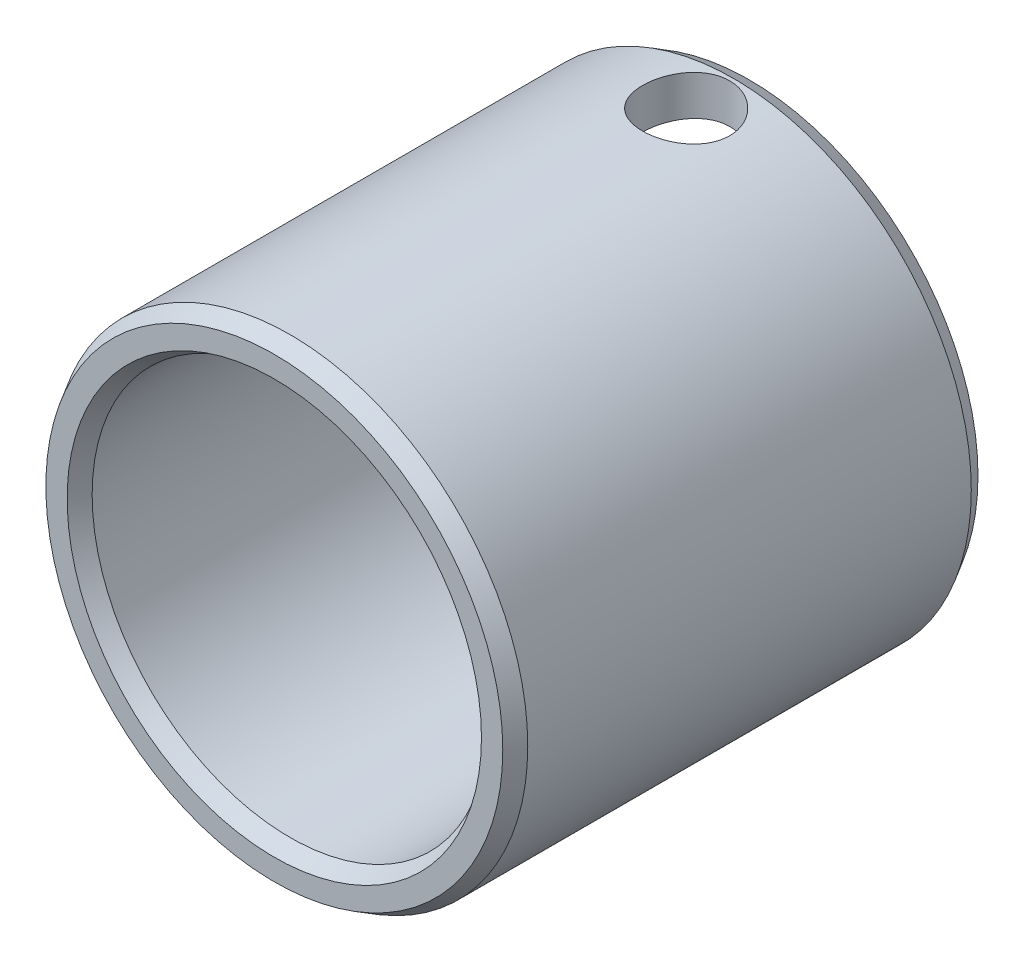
ISO-10303-21;
HEADER;
FILE_DESCRIPTION(('STEP AP214'),'2;1');
FILE_NAME('part.step','',(''),(''),'','','');
FILE_SCHEMA(('AUTOMOTIVE_DESIGN { 1 0 10303 214 1 1 1 1 }'));
ENDSEC;
DATA;
#1=APPLICATION_CONTEXT('core data for automotive mechanical design processes');
#2=APPLICATION_PROTOCOL_DEFINITION('international standard','automotive_design',2000,#1);
#3=PRODUCT_CONTEXT('',#1,'mechanical');
#4=PRODUCT('Part','Part','',(#3));
#5=PRODUCT_RELATED_PRODUCT_CATEGORY('part','',(#4));
#6=PRODUCT_DEFINITION_FORMATION('','',#4);
#7=PRODUCT_DEFINITION_CONTEXT('part definition',#1,'design');
#8=PRODUCT_DEFINITION('design','',#6,#7);
#9=PRODUCT_DEFINITION_SHAPE('','',#8);
#10=(LENGTH_UNIT() NAMED_UNIT(*) SI_UNIT(.MILLI.,.METRE.));
#11=(NAMED_UNIT(*) PLANE_ANGLE_UNIT() SI_UNIT($,.RADIAN.));
#12=(NAMED_UNIT(*) SI_UNIT($,.STERADIAN.) SOLID_ANGLE_UNIT());
#13=UNCERTAINTY_MEASURE_WITH_UNIT(LENGTH_MEASURE(1.E-05),#10,'distance_accuracy_value','');
#14=(GEOMETRIC_REPRESENTATION_CONTEXT(3) GLOBAL_UNCERTAINTY_ASSIGNED_CONTEXT((#13)) GLOBAL_UNIT_ASSIGNED_CONTEXT((#10,
#11,#12)) REPRESENTATION_CONTEXT('',''));
#15=CARTESIAN_POINT('',(0.,0.,0.));
#16=DIRECTION('',(0.,0.,1.));
#17=DIRECTION('',(1.,0.,0.));
#18=AXIS2_PLACEMENT_3D('',#15,#16,#17);
#19=CARTESIAN_POINT('',(0.,0.,35.150250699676));
#20=DIRECTION('',(0.,0.,1.));
#21=DIRECTION('',(1.,0.,0.));
#22=AXIS2_PLACEMENT_3D('',#19,#20,#21);
#23=CYLINDRICAL_SURFACE('',#22,12.5);
#24=CARTESIAN_POINT('',(0.,0.,29.));
#25=DIRECTION('',(0.,0.,1.));
#26=DIRECTION('',(1.,0.,0.));
#27=AXIS2_PLACEMENT_3D('',#24,#25,#26);
#28=CIRCLE('',#27,12.5);
#29=CARTESIAN_POINT('',(12.5,0.,29.));
#30=VERTEX_POINT('',#29);
#31=EDGE_CURVE('E29',#30,#30,#28,.T.);
#32=ORIENTED_EDGE('',*,*,#31,.T.);
#33=EDGE_LOOP('',(#32));
#34=FACE_BOUND('',#33,.T.);
#35=CARTESIAN_POINT('',(0.,0.,1.));
#36=DIRECTION('',(0.,0.,1.));
#37=DIRECTION('',(1.,0.,0.));
#38=AXIS2_PLACEMENT_3D('',#35,#36,#37);
#39=CIRCLE('',#38,12.5);
#40=CARTESIAN_POINT('',(12.5,0.,1.));
#41=VERTEX_POINT('',#40);
#42=EDGE_CURVE('E34',#41,#41,#39,.T.);
#43=ORIENTED_EDGE('',*,*,#42,.F.);
#44=EDGE_LOOP('',(#43));
#45=FACE_BOUND('',#44,.T.);
#46=CARTESIAN_POINT('',(0.,12.5,6.75));
#47=CARTESIAN_POINT('',(0.152499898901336,12.4999971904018,6.74999482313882));
#48=CARTESIAN_POINT('',(0.305062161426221,12.4971809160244,6.73727196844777));
#49=CARTESIAN_POINT('',(0.605851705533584,12.4862182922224,6.6867704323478));
#50=CARTESIAN_POINT('',(0.754075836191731,12.4780681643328,6.64897398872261));
#51=CARTESIAN_POINT('',(1.04179873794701,12.4573450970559,6.54956758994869));
#52=CARTESIAN_POINT('',(1.18130649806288,12.444776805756,6.48798265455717));
#53=CARTESIAN_POINT('',(1.44800450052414,12.4165731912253,6.34282718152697));
#54=CARTESIAN_POINT('',(1.57519503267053,12.4009379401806,6.25925716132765));
#55=CARTESIAN_POINT('',(1.81571618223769,12.3680290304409,6.07106914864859));
#56=CARTESIAN_POINT('',(1.92881838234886,12.3507348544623,5.96616278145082));
#57=CARTESIAN_POINT('',(2.13597154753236,12.3166015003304,5.73889900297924));
#58=CARTESIAN_POINT('',(2.23002079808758,12.2997623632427,5.61654002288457));
#59=CARTESIAN_POINT('',(2.39740867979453,12.2682432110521,5.35615223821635));
#60=CARTESIAN_POINT('',(2.47050367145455,12.2535894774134,5.21796334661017));
#61=CARTESIAN_POINT('',(2.59234515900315,12.2283949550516,4.93088790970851));
#62=CARTESIAN_POINT('',(2.64109460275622,12.2178536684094,4.7820026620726));
#63=CARTESIAN_POINT('',(2.71210534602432,12.2022865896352,4.48023993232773));
#64=CARTESIAN_POINT('',(2.73477130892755,12.1971766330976,4.32746211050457));
#65=CARTESIAN_POINT('',(2.75423002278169,12.1927980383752,4.02019344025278));
#66=CARTESIAN_POINT('',(2.75102599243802,12.1935286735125,3.86570280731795));
#67=CARTESIAN_POINT('',(2.71916121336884,12.2006725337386,3.56240580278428));
#68=CARTESIAN_POINT('',(2.69097101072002,12.2069807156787,3.41354714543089));
#69=CARTESIAN_POINT('',(2.61067978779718,12.2244027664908,3.12272514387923));
#70=CARTESIAN_POINT('',(2.5585774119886,12.2355169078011,2.98076219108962));
#71=CARTESIAN_POINT('',(2.43150997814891,12.2614018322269,2.70644094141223));
#72=CARTESIAN_POINT('',(2.35636438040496,12.2762013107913,2.57416909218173));
#73=CARTESIAN_POINT('',(2.18547052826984,12.307771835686,2.32393863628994));
#74=CARTESIAN_POINT('',(2.0897194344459,12.3245431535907,2.20598200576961));
#75=CARTESIAN_POINT('',(1.87784383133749,12.3586180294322,1.985021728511));
#76=CARTESIAN_POINT('',(1.76131931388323,12.3759252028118,1.88240181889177));
#77=CARTESIAN_POINT('',(1.51251817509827,12.4087875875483,1.69809729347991));
#78=CARTESIAN_POINT('',(1.38024126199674,12.4243427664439,1.61641306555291));
#79=CARTESIAN_POINT('',(1.10321877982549,12.4519999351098,1.47620205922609));
#80=CARTESIAN_POINT('',(0.95844672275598,12.4640943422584,1.41772602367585));
#81=CARTESIAN_POINT('',(0.660806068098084,12.4834109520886,1.32603764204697));
#82=CARTESIAN_POINT('',(0.507938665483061,12.4906338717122,1.29282157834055));
#83=CARTESIAN_POINT('',(0.201737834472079,12.4992914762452,1.25315522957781));
#84=CARTESIAN_POINT('',(0.0484754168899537,12.5008394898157,1.24618081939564));
#85=CARTESIAN_POINT('',(-0.257024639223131,12.4982906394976,1.25777449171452));
#86=CARTESIAN_POINT('',(-0.409262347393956,12.4941941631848,1.27634082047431));
#87=CARTESIAN_POINT('',(-0.706651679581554,12.4808881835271,1.33805441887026));
#88=CARTESIAN_POINT('',(-0.851863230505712,12.4717359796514,1.38092635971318));
#89=CARTESIAN_POINT('',(-1.13303374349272,12.4493431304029,1.48972826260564));
#90=CARTESIAN_POINT('',(-1.26899190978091,12.4361021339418,1.55566020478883));
#91=CARTESIAN_POINT('',(-1.52996043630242,12.4067211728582,1.70979963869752));
#92=CARTESIAN_POINT('',(-1.65478476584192,12.3905421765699,1.7983144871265));
#93=CARTESIAN_POINT('',(-1.88799618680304,12.3571587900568,1.99470285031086));
#94=CARTESIAN_POINT('',(-1.99638111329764,12.3399542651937,2.1025789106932));
#95=CARTESIAN_POINT('',(-2.19571266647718,12.3060667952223,2.33703379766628));
#96=CARTESIAN_POINT('',(-2.28629616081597,12.289399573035,2.46392405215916));
#97=CARTESIAN_POINT('',(-2.44486941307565,12.258840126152,2.7314240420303));
#98=CARTESIAN_POINT('',(-2.51286015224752,12.2449477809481,2.87203318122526));
#99=CARTESIAN_POINT('',(-2.62385616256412,12.2216446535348,3.16222361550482));
#100=CARTESIAN_POINT('',(-2.66700249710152,12.2122086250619,3.31174882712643));
#101=CARTESIAN_POINT('',(-2.72749692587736,12.198841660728,3.61616163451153));
#102=CARTESIAN_POINT('',(-2.74484920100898,12.1949098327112,3.77104835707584));
#103=CARTESIAN_POINT('',(-2.753083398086,12.1930531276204,4.07812494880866));
#104=CARTESIAN_POINT('',(-2.74454124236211,12.194997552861,4.23029886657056));
#105=CARTESIAN_POINT('',(-2.70251774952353,12.2043784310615,4.53098185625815));
#106=CARTESIAN_POINT('',(-2.66903671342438,12.2118148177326,4.67949097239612));
#107=CARTESIAN_POINT('',(-2.57836557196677,12.2312776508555,4.96816478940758));
#108=CARTESIAN_POINT('',(-2.52126021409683,12.243287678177,5.10835728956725));
#109=CARTESIAN_POINT('',(-2.385033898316,12.2705508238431,5.37725693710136));
#110=CARTESIAN_POINT('',(-2.30591061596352,12.2858042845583,5.50596286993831));
#111=CARTESIAN_POINT('',(-2.12598827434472,12.3182253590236,5.75107284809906));
#112=CARTESIAN_POINT('',(-2.02477917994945,12.3354257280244,5.86717163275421));
#113=CARTESIAN_POINT('',(-1.80438792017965,12.3695834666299,6.08092655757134));
#114=CARTESIAN_POINT('',(-1.68520160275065,12.3865407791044,6.17857842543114));
#115=CARTESIAN_POINT('',(-1.43034911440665,12.4185664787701,6.35389858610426));
#116=CARTESIAN_POINT('',(-1.29448673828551,12.4336070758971,6.43128703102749));
#117=CARTESIAN_POINT('',(-1.0113796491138,12.459825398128,6.56200649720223));
#118=CARTESIAN_POINT('',(-0.864144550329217,12.4710063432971,6.61535758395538));
#119=CARTESIAN_POINT('',(-0.597314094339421,12.4862635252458,6.68703961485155));
#120=CARTESIAN_POINT('',(-0.479156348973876,12.4913826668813,6.71060448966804));
#121=CARTESIAN_POINT('',(-0.24067861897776,12.4982519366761,6.7420863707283));
#122=CARTESIAN_POINT('',(-0.120358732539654,12.500002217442,6.75000408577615));
#123=CARTESIAN_POINT('',(0.,12.5,6.75));
#124=B_SPLINE_CURVE_WITH_KNOTS('',3,(#46,#47,#48,#49,#50,#51,#52,#53,#54,#55,#56,#57,#58,#59,
#60,#61,#62,#63,#64,#65,#66,#67,#68,#69,#70,#71,#72,#73,#74,#75,#76,#77,#78,#79,#80,#81,#82,#83,
#84,#85,#86,#87,#88,#89,#90,#91,#92,#93,#94,#95,#96,#97,#98,#99,#100,#101,#102,#103,#104,#105,
#106,#107,#108,#109,#110,#111,#112,#113,#114,#115,#116,#117,#118,#119,#120,#121,#122,#123),
.UNSPECIFIED.,.T.,.F.,(4,2,2,2,2,2,2,2,2,2,2,2,2,2,2,2,2,2,2,2,2,2,2,2,2,2,2,2,2,2,2,2,2,2,2,2,
2,2,4),(0.,0.457059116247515,0.914442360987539,1.37134585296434,1.82823859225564,
2.29177467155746,2.7553524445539,3.22411991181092,3.69283060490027,4.15416721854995,
4.61544643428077,5.06821903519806,5.52101730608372,5.97745796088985,6.43396155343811,
6.90045562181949,7.36695833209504,7.83447546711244,8.30192378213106,8.75998460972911,
9.21801398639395,9.67095570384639,10.1239363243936,10.5834456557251,11.0430154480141,
11.5111606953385,11.9792856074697,12.444725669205,12.9100902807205,13.3651811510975,
13.8202665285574,14.2737333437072,14.7272480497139,15.1900335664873,15.6529261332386,
16.1219093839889,16.5905004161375,16.9512452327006,17.3119737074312),.UNSPECIFIED.);
#125=CARTESIAN_POINT('',(0.,12.5,6.75));
#126=VERTEX_POINT('',#125);
#127=EDGE_CURVE('E49',#126,#126,#124,.T.);
#128=ORIENTED_EDGE('',*,*,#127,.T.);
#129=EDGE_LOOP('',(#128));
#130=FACE_BOUND('',#129,.T.);
#131=ADVANCED_FACE('F12',(#34,#45,#130),#23,.F.);
#132=CARTESIAN_POINT('',(0.,0.,35.150250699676));
#133=DIRECTION('',(0.,0.,1.));
#134=DIRECTION('',(1.,0.,0.));
#135=AXIS2_PLACEMENT_3D('',#132,#133,#134);
#136=CYLINDRICAL_SURFACE('',#135,15.);
#137=CARTESIAN_POINT('',(0.,0.,29.));
#138=DIRECTION('',(0.,0.,1.));
#139=DIRECTION('',(1.,0.,0.));
#140=AXIS2_PLACEMENT_3D('',#137,#138,#139);
#141=CIRCLE('',#140,15.);
#142=CARTESIAN_POINT('',(15.,0.,29.));
#143=VERTEX_POINT('',#142);
#144=EDGE_CURVE('E46',#143,#143,#141,.T.);
#145=ORIENTED_EDGE('',*,*,#144,.F.);
#146=EDGE_LOOP('',(#145));
#147=FACE_BOUND('',#146,.T.);
#148=CARTESIAN_POINT('',(0.,0.,1.));
#149=DIRECTION('',(0.,0.,1.));
#150=DIRECTION('',(1.,0.,0.));
#151=AXIS2_PLACEMENT_3D('',#148,#149,#150);
#152=CIRCLE('',#151,15.);
#153=CARTESIAN_POINT('',(15.,0.,1.));
#154=VERTEX_POINT('',#153);
#155=EDGE_CURVE('E43',#154,#154,#152,.T.);
#156=ORIENTED_EDGE('',*,*,#155,.T.);
#157=EDGE_LOOP('',(#156));
#158=FACE_BOUND('',#157,.T.);
#159=CARTESIAN_POINT('',(0.,15.,6.75));
#160=CARTESIAN_POINT('',(-0.153093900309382,14.9999972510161,6.74999408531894));
#161=CARTESIAN_POINT('',(-0.30626547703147,14.9976319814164,6.73717257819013));
#162=CARTESIAN_POINT('',(-0.608296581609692,14.9884243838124,6.68625588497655));
#163=CARTESIAN_POINT('',(-0.757152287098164,14.9815782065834,6.64813896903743));
#164=CARTESIAN_POINT('',(-1.04613957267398,14.9641750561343,6.54783432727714));
#165=CARTESIAN_POINT('',(-1.18627875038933,14.9536213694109,6.48566791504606));
#166=CARTESIAN_POINT('',(-1.45412377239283,14.9299573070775,6.3390885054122));
#167=CARTESIAN_POINT('',(-1.58183070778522,14.9168471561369,6.25467746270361));
#168=CARTESIAN_POINT('',(-1.82266517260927,14.8893503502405,6.06497648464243));
#169=CARTESIAN_POINT('',(-1.93562942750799,14.8749519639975,5.95948094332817));
#170=CARTESIAN_POINT('',(-2.1423598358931,14.846589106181,5.73104795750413));
#171=CARTESIAN_POINT('',(-2.23612464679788,14.8326246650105,5.60810929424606));
#172=CARTESIAN_POINT('',(-2.40246850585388,14.806596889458,5.34713263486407));
#173=CARTESIAN_POINT('',(-2.47488242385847,14.7945486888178,5.20898774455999));
#174=CARTESIAN_POINT('',(-2.59541207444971,14.7738823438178,4.922235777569));
#175=CARTESIAN_POINT('',(-2.64352980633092,14.7652639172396,4.77362956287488));
#176=CARTESIAN_POINT('',(-2.71357916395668,14.7525507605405,4.47191708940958));
#177=CARTESIAN_POINT('',(-2.73579495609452,14.7484069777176,4.31887891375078));
#178=CARTESIAN_POINT('',(-2.75429164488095,14.7449642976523,4.01119549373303));
#179=CARTESIAN_POINT('',(-2.75057476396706,14.7456649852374,3.8565503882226));
#180=CARTESIAN_POINT('',(-2.71754225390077,14.7517873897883,3.55209529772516));
#181=CARTESIAN_POINT('',(-2.68854893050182,14.7571496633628,3.40224897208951));
#182=CARTESIAN_POINT('',(-2.60629376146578,14.7718977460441,3.1095840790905));
#183=CARTESIAN_POINT('',(-2.55303092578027,14.7812837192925,2.96676579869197));
#184=CARTESIAN_POINT('',(-2.42343106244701,14.8030842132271,2.69126347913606));
#185=CARTESIAN_POINT('',(-2.34696312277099,14.8155158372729,2.5586424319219));
#186=CARTESIAN_POINT('',(-2.17321635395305,14.841995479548,2.3079923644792));
#187=CARTESIAN_POINT('',(-2.0759355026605,14.8560436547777,2.18996476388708));
#188=CARTESIAN_POINT('',(-1.86158278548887,14.8844329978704,1.96998902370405));
#189=CARTESIAN_POINT('',(-1.74423505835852,14.8987753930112,1.86830966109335));
#190=CARTESIAN_POINT('',(-1.4940048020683,14.925942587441,1.68604048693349));
#191=CARTESIAN_POINT('',(-1.36112212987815,14.9387673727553,1.6054508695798));
#192=CARTESIAN_POINT('',(-1.08331945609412,14.9614785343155,1.46761241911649));
#193=CARTESIAN_POINT('',(-0.938385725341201,14.9713614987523,1.4103906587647));
#194=CARTESIAN_POINT('',(-0.640742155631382,14.9870489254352,1.32117929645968));
#195=CARTESIAN_POINT('',(-0.488033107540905,14.9928538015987,1.28918713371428));
#196=CARTESIAN_POINT('',(-0.1814870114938,14.999674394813,1.25171517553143));
#197=CARTESIAN_POINT('',(-0.0276964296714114,15.0007566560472,1.24586696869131));
#198=CARTESIAN_POINT('',(0.278665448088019,14.9981935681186,1.25986196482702));
#199=CARTESIAN_POINT('',(0.431236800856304,14.9945484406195,1.27970396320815));
#200=CARTESIAN_POINT('',(0.729667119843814,14.9829815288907,1.34420979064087));
#201=CARTESIAN_POINT('',(0.875567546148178,14.9750917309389,1.38868804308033));
#202=CARTESIAN_POINT('',(1.15784057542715,14.9559164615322,1.501003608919));
#203=CARTESIAN_POINT('',(1.2942125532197,14.9446307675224,1.56884245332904));
#204=CARTESIAN_POINT('',(1.55513574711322,14.9197496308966,1.72677482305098));
#205=CARTESIAN_POINT('',(1.67954783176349,14.9061311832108,1.81709451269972));
#206=CARTESIAN_POINT('',(1.91158174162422,14.8781564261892,2.01711764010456));
#207=CARTESIAN_POINT('',(2.01920207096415,14.8638000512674,2.12682280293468));
#208=CARTESIAN_POINT('',(2.21599031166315,14.8357478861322,2.36416748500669));
#209=CARTESIAN_POINT('',(2.30490730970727,14.8220627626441,2.49201651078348));
#210=CARTESIAN_POINT('',(2.46000320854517,14.7971139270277,2.76105288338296));
#211=CARTESIAN_POINT('',(2.52618293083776,14.7858501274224,2.90223974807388));
#212=CARTESIAN_POINT('',(2.63356582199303,14.7671022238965,3.19329356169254));
#213=CARTESIAN_POINT('',(2.67488605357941,14.7596004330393,3.34311612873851));
#214=CARTESIAN_POINT('',(2.73173972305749,14.7491846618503,3.64772693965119));
#215=CARTESIAN_POINT('',(2.74727592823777,14.746270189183,3.80251464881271));
#216=CARTESIAN_POINT('',(2.75203112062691,14.7453832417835,4.11015028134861));
#217=CARTESIAN_POINT('',(2.74164570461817,14.7473364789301,4.26299201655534));
#218=CARTESIAN_POINT('',(2.69571632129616,14.7558005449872,4.56471215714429));
#219=CARTESIAN_POINT('',(2.66017248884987,14.7623113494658,4.71359058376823));
#220=CARTESIAN_POINT('',(2.56509900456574,14.77912629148,5.00295766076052));
#221=CARTESIAN_POINT('',(2.50561036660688,14.7894239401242,5.14346018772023));
#222=CARTESIAN_POINT('',(2.36437859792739,14.8126571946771,5.41255379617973));
#223=CARTESIAN_POINT('',(2.28263399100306,14.8255929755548,5.54114408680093));
#224=CARTESIAN_POINT('',(2.09782771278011,14.8528765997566,5.78474827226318));
#225=CARTESIAN_POINT('',(1.99447745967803,14.8672420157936,5.89954130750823));
#226=CARTESIAN_POINT('',(1.76999701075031,14.8956330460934,6.11028811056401));
#227=CARTESIAN_POINT('',(1.64886273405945,14.9096585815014,6.20623754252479));
#228=CARTESIAN_POINT('',(1.39101348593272,14.9359299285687,6.37733686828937));
#229=CARTESIAN_POINT('',(1.25417414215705,14.9481594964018,6.45230189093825));
#230=CARTESIAN_POINT('',(0.969665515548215,14.9693025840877,6.57805965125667));
#231=CARTESIAN_POINT('',(0.822006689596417,14.9782192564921,6.62887538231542));
#232=CARTESIAN_POINT('',(0.561569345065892,14.9898870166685,6.69442423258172));
#233=CARTESIAN_POINT('',(0.450325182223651,14.9936582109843,6.71523000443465));
#234=CARTESIAN_POINT('',(0.226068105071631,14.9987156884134,6.74301990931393));
#235=CARTESIAN_POINT('',(0.11305523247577,15.0000020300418,6.75000436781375));
#236=CARTESIAN_POINT('',(0.,15.,6.75));
#237=B_SPLINE_CURVE_WITH_KNOTS('',3,(#159,#160,#161,#162,#163,#164,#165,#166,#167,#168,#169,
#170,#171,#172,#173,#174,#175,#176,#177,#178,#179,#180,#181,#182,#183,#184,#185,#186,#187,#188,
#189,#190,#191,#192,#193,#194,#195,#196,#197,#198,#199,#200,#201,#202,#203,#204,#205,#206,#207,
#208,#209,#210,#211,#212,#213,#214,#215,#216,#217,#218,#219,#220,#221,#222,#223,#224,#225,#226,
#227,#228,#229,#230,#231,#232,#233,#234,#235,#236),.UNSPECIFIED.,.T.,.F.,(4,2,2,2,2,2,2,2,2,2,2,
2,2,2,2,2,2,2,2,2,2,2,2,2,2,2,2,2,2,2,2,2,2,2,2,2,2,2,4),(0.,0.458868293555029,
0.918131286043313,1.3769881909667,1.83580478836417,2.29933541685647,2.76289844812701,
3.229957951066,3.69697901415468,4.15882675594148,4.62063491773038,5.07663918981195,
5.53266206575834,5.99130700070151,6.44999651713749,6.91559042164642,7.38118861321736,
7.84732470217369,8.31341347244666,8.77291314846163,9.23239127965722,9.68845448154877,
10.1445475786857,10.6054289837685,11.0663514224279,11.5331103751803,11.9998524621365,
12.4643791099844,12.9288558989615,13.3862876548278,13.8437169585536,14.3003660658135,
14.757045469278,15.2202665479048,15.6835940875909,16.1508835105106,16.6177271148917,
16.956595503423,17.2954559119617),.UNSPECIFIED.);
#238=CARTESIAN_POINT('',(0.,15.,6.75));
#239=VERTEX_POINT('',#238);
#240=EDGE_CURVE('E16',#239,#239,#237,.T.);
#241=ORIENTED_EDGE('',*,*,#240,.T.);
#242=EDGE_LOOP('',(#241));
#243=FACE_BOUND('',#242,.T.);
#244=ADVANCED_FACE('F63',(#147,#158,#243),#136,.T.);
#245=CARTESIAN_POINT('',(0.,0.,29.));
#246=DIRECTION('',(0.,0.,-1.));
#247=DIRECTION('',(-1.,0.,0.));
#248=AXIS2_PLACEMENT_3D('',#245,#246,#247);
#249=CONICAL_SURFACE('',#248,15.,0.523598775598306);
#250=CARTESIAN_POINT('',(0.,0.,30.));
#251=DIRECTION('',(0.,0.,1.));
#252=DIRECTION('',(1.,0.,0.));
#253=AXIS2_PLACEMENT_3D('',#250,#251,#252);
#254=CIRCLE('',#253,14.4226497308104);
#255=CARTESIAN_POINT('',(14.4226497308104,0.,30.));
#256=VERTEX_POINT('',#255);
#257=EDGE_CURVE('E8',#256,#256,#254,.T.);
#258=ORIENTED_EDGE('',*,*,#257,.F.);
#259=EDGE_LOOP('',(#258));
#260=FACE_BOUND('',#259,.T.);
#261=ORIENTED_EDGE('',*,*,#144,.T.);
#262=EDGE_LOOP('',(#261));
#263=FACE_BOUND('',#262,.T.);
#264=ADVANCED_FACE('F14',(#260,#263),#249,.T.);
#265=CARTESIAN_POINT('',(0.,-13.0773502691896,30.));
#266=DIRECTION('',(0.,0.,1.));
#267=DIRECTION('',(1.,0.,0.));
#268=AXIS2_PLACEMENT_3D('',#265,#266,#267);
#269=PLANE('',#268);
#270=ORIENTED_EDGE('',*,*,#257,.T.);
#271=EDGE_LOOP('',(#270));
#272=FACE_BOUND('',#271,.T.);
#273=CARTESIAN_POINT('',(0.,0.,30.));
#274=DIRECTION('',(0.,0.,1.));
#275=DIRECTION('',(1.,0.,0.));
#276=AXIS2_PLACEMENT_3D('',#273,#274,#275);
#277=CIRCLE('',#276,13.0773502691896);
#278=CARTESIAN_POINT('',(13.0773502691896,0.,30.));
#279=VERTEX_POINT('',#278);
#280=EDGE_CURVE('E25',#279,#279,#277,.T.);
#281=ORIENTED_EDGE('',*,*,#280,.F.);
#282=EDGE_LOOP('',(#281));
#283=FACE_BOUND('',#282,.T.);
#284=ADVANCED_FACE('F84',(#272,#283),#269,.T.);
#285=CARTESIAN_POINT('',(0.,0.,29.));
#286=DIRECTION('',(0.,0.,1.));
#287=DIRECTION('',(1.,0.,0.));
#288=AXIS2_PLACEMENT_3D('',#285,#286,#287);
#289=CONICAL_SURFACE('',#288,12.5,0.523598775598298);
#290=ORIENTED_EDGE('',*,*,#280,.T.);
#291=EDGE_LOOP('',(#290));
#292=FACE_BOUND('',#291,.T.);
#293=ORIENTED_EDGE('',*,*,#31,.F.);
#294=EDGE_LOOP('',(#293));
#295=FACE_BOUND('',#294,.T.);
#296=ADVANCED_FACE('F77',(#292,#295),#289,.F.);
#297=CARTESIAN_POINT('',(0.,0.,1.));
#298=DIRECTION('',(0.,0.,-1.));
#299=DIRECTION('',(-1.,0.,0.));
#300=AXIS2_PLACEMENT_3D('',#297,#298,#299);
#301=CONICAL_SURFACE('',#300,12.5,0.523598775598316);
#302=CARTESIAN_POINT('',(0.,0.,0.));
#303=DIRECTION('',(0.,0.,1.));
#304=DIRECTION('',(1.,0.,0.));
#305=AXIS2_PLACEMENT_3D('',#302,#303,#304);
#306=CIRCLE('',#305,13.0773502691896);
#307=CARTESIAN_POINT('',(13.0773502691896,0.,0.));
#308=VERTEX_POINT('',#307);
#309=EDGE_CURVE('E37',#308,#308,#306,.T.);
#310=ORIENTED_EDGE('',*,*,#309,.F.);
#311=EDGE_LOOP('',(#310));
#312=FACE_BOUND('',#311,.T.);
#313=ORIENTED_EDGE('',*,*,#42,.T.);
#314=EDGE_LOOP('',(#313));
#315=FACE_BOUND('',#314,.T.);
#316=ADVANCED_FACE('F74',(#312,#315),#301,.F.);
#317=CARTESIAN_POINT('',(0.,-14.4226497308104,0.));
#318=DIRECTION('',(0.,0.,-1.));
#319=DIRECTION('',(-1.,0.,0.));
#320=AXIS2_PLACEMENT_3D('',#317,#318,#319);
#321=PLANE('',#320);
#322=ORIENTED_EDGE('',*,*,#309,.T.);
#323=EDGE_LOOP('',(#322));
#324=FACE_BOUND('',#323,.T.);
#325=CARTESIAN_POINT('',(0.,0.,0.));
#326=DIRECTION('',(0.,0.,1.));
#327=DIRECTION('',(1.,0.,0.));
#328=AXIS2_PLACEMENT_3D('',#325,#326,#327);
#329=CIRCLE('',#328,14.4226497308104);
#330=CARTESIAN_POINT('',(14.4226497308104,0.,0.));
#331=VERTEX_POINT('',#330);
#332=EDGE_CURVE('E40',#331,#331,#329,.T.);
#333=ORIENTED_EDGE('',*,*,#332,.F.);
#334=EDGE_LOOP('',(#333));
#335=FACE_BOUND('',#334,.T.);
#336=ADVANCED_FACE('F71',(#324,#335),#321,.T.);
#337=CARTESIAN_POINT('',(0.,0.,1.));
#338=DIRECTION('',(0.,0.,1.));
#339=DIRECTION('',(1.,0.,0.));
#340=AXIS2_PLACEMENT_3D('',#337,#338,#339);
#341=CONICAL_SURFACE('',#340,15.,0.523598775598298);
#342=ORIENTED_EDGE('',*,*,#332,.T.);
#343=EDGE_LOOP('',(#342));
#344=FACE_BOUND('',#343,.T.);
#345=ORIENTED_EDGE('',*,*,#155,.F.);
#346=EDGE_LOOP('',(#345));
#347=FACE_BOUND('',#346,.T.);
#348=ADVANCED_FACE('F61',(#344,#347),#341,.T.);
#349=CARTESIAN_POINT('',(0.,20.,4.));
#350=DIRECTION('',(0.,-1.,0.));
#351=DIRECTION('',(0.,0.,1.));
#352=AXIS2_PLACEMENT_3D('',#349,#350,#351);
#353=CYLINDRICAL_SURFACE('',#352,2.75);
#354=ORIENTED_EDGE('',*,*,#127,.F.);
#355=EDGE_LOOP('',(#354));
#356=FACE_BOUND('',#355,.T.);
#357=ORIENTED_EDGE('',*,*,#240,.F.);
#358=EDGE_LOOP('',(#357));
#359=FACE_BOUND('',#358,.T.);
#360=ADVANCED_FACE('F58',(#356,#359),#353,.F.);
#361=CLOSED_SHELL('',(#131,#244,#264,#284,#296,#316,#336,#348,#360));
#362=MANIFOLD_SOLID_BREP('B1',#361);
#363=ADVANCED_BREP_SHAPE_REPRESENTATION('',(#18,#362),#14);
#364=SHAPE_DEFINITION_REPRESENTATION(#9,#363);
ENDSEC;
END-ISO-10303-21;
